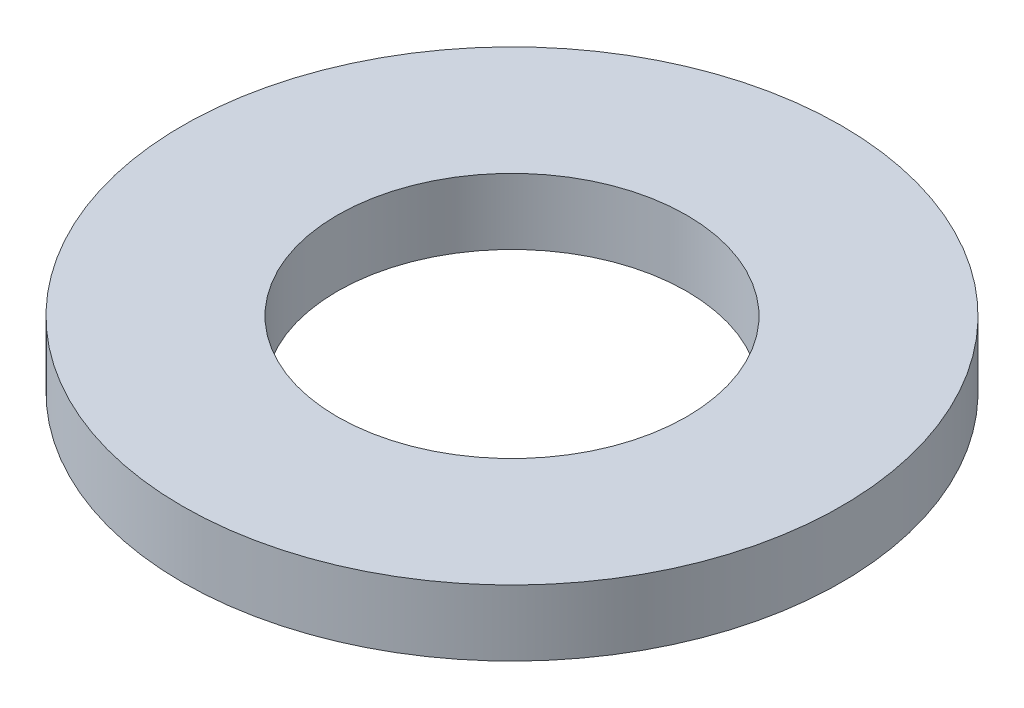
from build123d import *

# Parameters (mm, degrees)
SKETCH1_R      = 5
SKETCH1_R_2    = 2.65
EXTRUDE1_DEPTH = 1


with BuildPart() as part:
    # Sketch1 → Extrude1 (new body)
    with BuildSketch(Plane(origin=(0, 0, 0), x_dir=(1, 0, 0), z_dir=(0, 1, 0))):
        with Locations(Location((0, 0, 0), (0, 0, 270))):
            Circle(SKETCH1_R)
        with Locations(Location((0, 0, 0), (0, 0, 270))):
            Circle(SKETCH1_R_2, mode=Mode.SUBTRACT)
    extrude(amount=EXTRUDE1_DEPTH)


solid = part.part
